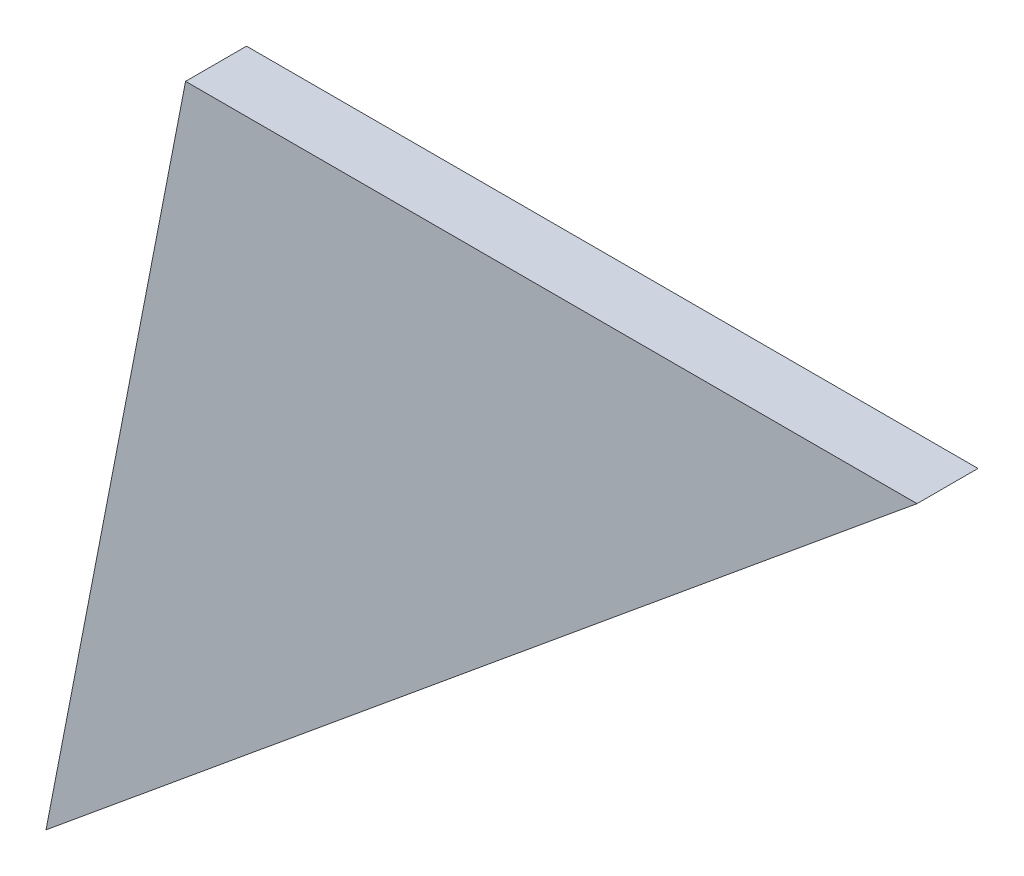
ISO-10303-21;
HEADER;
FILE_DESCRIPTION(('STEP AP214'),'2;1');
FILE_NAME('part.step','',(''),(''),'','','');
FILE_SCHEMA(('AUTOMOTIVE_DESIGN { 1 0 10303 214 1 1 1 1 }'));
ENDSEC;
DATA;
#1=APPLICATION_CONTEXT('core data for automotive mechanical design processes');
#2=APPLICATION_PROTOCOL_DEFINITION('international standard','automotive_design',2000,#1);
#3=PRODUCT_CONTEXT('',#1,'mechanical');
#4=PRODUCT('Part','Part','',(#3));
#5=PRODUCT_RELATED_PRODUCT_CATEGORY('part','',(#4));
#6=PRODUCT_DEFINITION_FORMATION('','',#4);
#7=PRODUCT_DEFINITION_CONTEXT('part definition',#1,'design');
#8=PRODUCT_DEFINITION('design','',#6,#7);
#9=PRODUCT_DEFINITION_SHAPE('','',#8);
#10=(LENGTH_UNIT() NAMED_UNIT(*) SI_UNIT(.MILLI.,.METRE.));
#11=(NAMED_UNIT(*) PLANE_ANGLE_UNIT() SI_UNIT($,.RADIAN.));
#12=(NAMED_UNIT(*) SI_UNIT($,.STERADIAN.) SOLID_ANGLE_UNIT());
#13=UNCERTAINTY_MEASURE_WITH_UNIT(LENGTH_MEASURE(1.E-05),#10,'distance_accuracy_value','');
#14=(GEOMETRIC_REPRESENTATION_CONTEXT(3) GLOBAL_UNCERTAINTY_ASSIGNED_CONTEXT((#13)) GLOBAL_UNIT_ASSIGNED_CONTEXT((#10,
#11,#12)) REPRESENTATION_CONTEXT('',''));
#15=CARTESIAN_POINT('',(0.,0.,0.));
#16=DIRECTION('',(0.,0.,1.));
#17=DIRECTION('',(1.,0.,0.));
#18=AXIS2_PLACEMENT_3D('',#15,#16,#17);
#19=CARTESIAN_POINT('',(0.,0.,6.35));
#20=DIRECTION('',(0.981627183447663,-0.190808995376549,0.));
#21=DIRECTION('',(0.190808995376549,0.981627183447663,0.));
#22=AXIS2_PLACEMENT_3D('',#19,#20,#21);
#23=PLANE('',#22);
#24=DIRECTION('',(-0.190808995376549,-0.981627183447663,0.));
#25=VECTOR('',#24,1.);
#26=CARTESIAN_POINT('',(0.,0.,0.));
#27=LINE('',#26,#25);
#28=CARTESIAN_POINT('',(0.,0.,0.));
#29=VERTEX_POINT('',#28);
#30=CARTESIAN_POINT('',(-14.539645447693,-74.799991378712,0.));
#31=VERTEX_POINT('',#30);
#32=EDGE_CURVE('E62',#29,#31,#27,.T.);
#33=ORIENTED_EDGE('',*,*,#32,.T.);
#34=DIRECTION('',(0.,0.,-1.));
#35=VECTOR('',#34,1.);
#36=CARTESIAN_POINT('',(-14.539645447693,-74.799991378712,6.35));
#37=LINE('',#36,#35);
#38=CARTESIAN_POINT('',(-14.539645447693,-74.799991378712,6.35));
#39=VERTEX_POINT('',#38);
#40=EDGE_CURVE('E11',#39,#31,#37,.T.);
#41=ORIENTED_EDGE('',*,*,#40,.F.);
#42=DIRECTION('',(-0.190808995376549,-0.981627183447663,0.));
#43=VECTOR('',#42,1.);
#44=CARTESIAN_POINT('',(0.,0.,6.35));
#45=LINE('',#44,#43);
#46=CARTESIAN_POINT('',(0.,0.,6.35));
#47=VERTEX_POINT('',#46);
#48=EDGE_CURVE('E76',#47,#39,#45,.T.);
#49=ORIENTED_EDGE('',*,*,#48,.F.);
#50=DIRECTION('',(0.,0.,-1.));
#51=VECTOR('',#50,1.);
#52=CARTESIAN_POINT('',(0.,0.,6.35));
#53=LINE('',#52,#51);
#54=EDGE_CURVE('E72',#47,#29,#53,.T.);
#55=ORIENTED_EDGE('',*,*,#54,.T.);
#56=EDGE_LOOP('',(#33,#41,#49,#55));
#57=FACE_BOUND('',#56,.T.);
#58=ADVANCED_FACE('F26',(#57),#23,.F.);
#59=CARTESIAN_POINT('',(-14.539645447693,-74.799991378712,6.35));
#60=DIRECTION('',(-0.636078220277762,0.771624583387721,0.));
#61=DIRECTION('',(-0.771624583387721,-0.636078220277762,0.));
#62=AXIS2_PLACEMENT_3D('',#59,#60,#61);
#63=PLANE('',#62);
#64=DIRECTION('',(0.771624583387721,0.636078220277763,0.));
#65=VECTOR('',#64,1.);
#66=CARTESIAN_POINT('',(-14.539645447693,-74.799991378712,0.));
#67=LINE('',#66,#65);
#68=CARTESIAN_POINT('',(76.2,0.,0.));
#69=VERTEX_POINT('',#68);
#70=EDGE_CURVE('E59',#31,#69,#67,.T.);
#71=ORIENTED_EDGE('',*,*,#70,.T.);
#72=DIRECTION('',(0.,0.,-1.));
#73=VECTOR('',#72,1.);
#74=CARTESIAN_POINT('',(76.2,0.,6.35));
#75=LINE('',#74,#73);
#76=CARTESIAN_POINT('',(76.2,0.,6.35));
#77=VERTEX_POINT('',#76);
#78=EDGE_CURVE('E33',#77,#69,#75,.T.);
#79=ORIENTED_EDGE('',*,*,#78,.F.);
#80=DIRECTION('',(0.771624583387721,0.636078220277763,0.));
#81=VECTOR('',#80,1.);
#82=CARTESIAN_POINT('',(-14.539645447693,-74.799991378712,6.35));
#83=LINE('',#82,#81);
#84=EDGE_CURVE('E44',#39,#77,#83,.T.);
#85=ORIENTED_EDGE('',*,*,#84,.F.);
#86=ORIENTED_EDGE('',*,*,#40,.T.);
#87=EDGE_LOOP('',(#71,#79,#85,#86));
#88=FACE_BOUND('',#87,.T.);
#89=ADVANCED_FACE('F68',(#88),#63,.F.);
#90=CARTESIAN_POINT('',(0.,0.,6.35));
#91=DIRECTION('',(0.,-1.,0.));
#92=DIRECTION('',(0.,0.,-1.));
#93=AXIS2_PLACEMENT_3D('',#90,#91,#92);
#94=PLANE('',#93);
#95=DIRECTION('',(-1.,0.,0.));
#96=VECTOR('',#95,1.);
#97=CARTESIAN_POINT('',(0.,0.,0.));
#98=LINE('',#97,#96);
#99=EDGE_CURVE('E63',#69,#29,#98,.T.);
#100=ORIENTED_EDGE('',*,*,#99,.T.);
#101=ORIENTED_EDGE('',*,*,#54,.F.);
#102=DIRECTION('',(-1.,0.,0.));
#103=VECTOR('',#102,1.);
#104=CARTESIAN_POINT('',(0.,0.,6.35));
#105=LINE('',#104,#103);
#106=EDGE_CURVE('E40',#77,#47,#105,.T.);
#107=ORIENTED_EDGE('',*,*,#106,.F.);
#108=ORIENTED_EDGE('',*,*,#78,.T.);
#109=EDGE_LOOP('',(#100,#101,#107,#108));
#110=FACE_BOUND('',#109,.T.);
#111=ADVANCED_FACE('F81',(#110),#94,.F.);
#112=CARTESIAN_POINT('',(0.,0.,6.35));
#113=DIRECTION('',(0.,0.,1.));
#114=DIRECTION('',(1.,0.,0.));
#115=AXIS2_PLACEMENT_3D('',#112,#113,#114);
#116=PLANE('',#115);
#117=ORIENTED_EDGE('',*,*,#48,.T.);
#118=ORIENTED_EDGE('',*,*,#84,.T.);
#119=ORIENTED_EDGE('',*,*,#106,.T.);
#120=EDGE_LOOP('',(#117,#118,#119));
#121=FACE_BOUND('',#120,.T.);
#122=ADVANCED_FACE('F82',(#121),#116,.T.);
#123=CARTESIAN_POINT('',(0.,0.,0.));
#124=DIRECTION('',(0.,0.,1.));
#125=DIRECTION('',(1.,0.,0.));
#126=AXIS2_PLACEMENT_3D('',#123,#124,#125);
#127=PLANE('',#126);
#128=ORIENTED_EDGE('',*,*,#32,.F.);
#129=ORIENTED_EDGE('',*,*,#99,.F.);
#130=ORIENTED_EDGE('',*,*,#70,.F.);
#131=EDGE_LOOP('',(#128,#129,#130));
#132=FACE_BOUND('',#131,.T.);
#133=ADVANCED_FACE('F60',(#132),#127,.F.);
#134=CLOSED_SHELL('',(#58,#89,#111,#122,#133));
#135=MANIFOLD_SOLID_BREP('B2',#134);
#136=ADVANCED_BREP_SHAPE_REPRESENTATION('',(#18,#135),#14);
#137=SHAPE_DEFINITION_REPRESENTATION(#9,#136);
ENDSEC;
END-ISO-10303-21;
